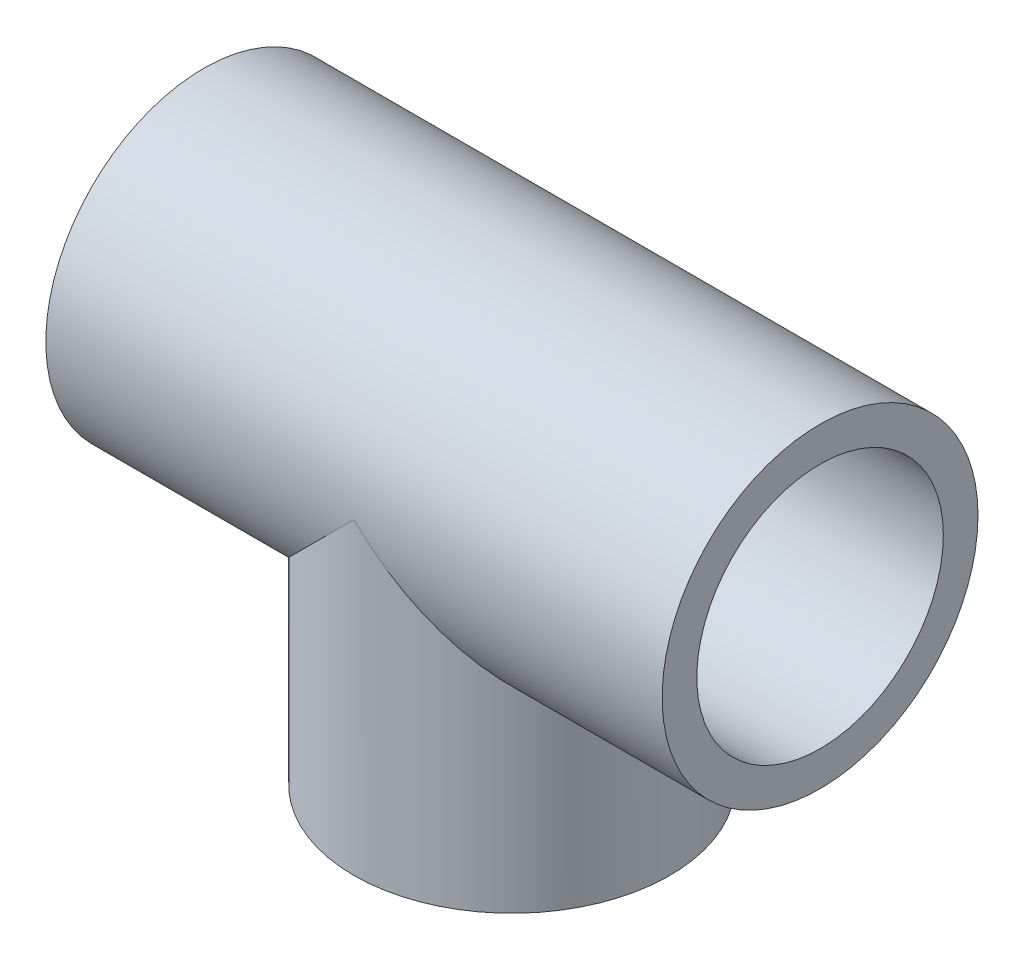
from build123d import *

# Parameters (mm, degrees)
SKETCH1_R           = 16
BOSS_EXTRUDE1_DEPTH = 40
SKETCH2_R           = 16
BOSS_EXTRUDE2_DEPTH = 40
SHELL1_T            = 4.5


with BuildPart() as part:
    # Sketch1 → Boss-Extrude1 (new, symmetric)
    with BuildSketch(Plane(origin=(0, 0, 0), x_dir=(0, 0, -1), z_dir=(1, 0, 0))):
        Circle(SKETCH1_R)
    extrude(amount=BOSS_EXTRUDE1_DEPTH, both=True)

    # Sketch2 → Boss-Extrude2 (add)
    with BuildSketch(Plane(origin=(0, 0, 0), x_dir=(1, 0, 0), z_dir=(0, 1, 0))):
        with Locations(Location((0, 0, 0), (0, 0, 270))):
            Circle(SKETCH2_R)
    extrude(amount=-BOSS_EXTRUDE2_DEPTH)

    # Shell1
    shell1_openings = [part.faces().sort_by_distance(p)[0] for p in [
        (40, 0, 0),
        (-40, 0, 0),
        (0, -40, 0),
    ]]
    offset(amount=SHELL1_T, openings=shell1_openings)


solid = part.part
